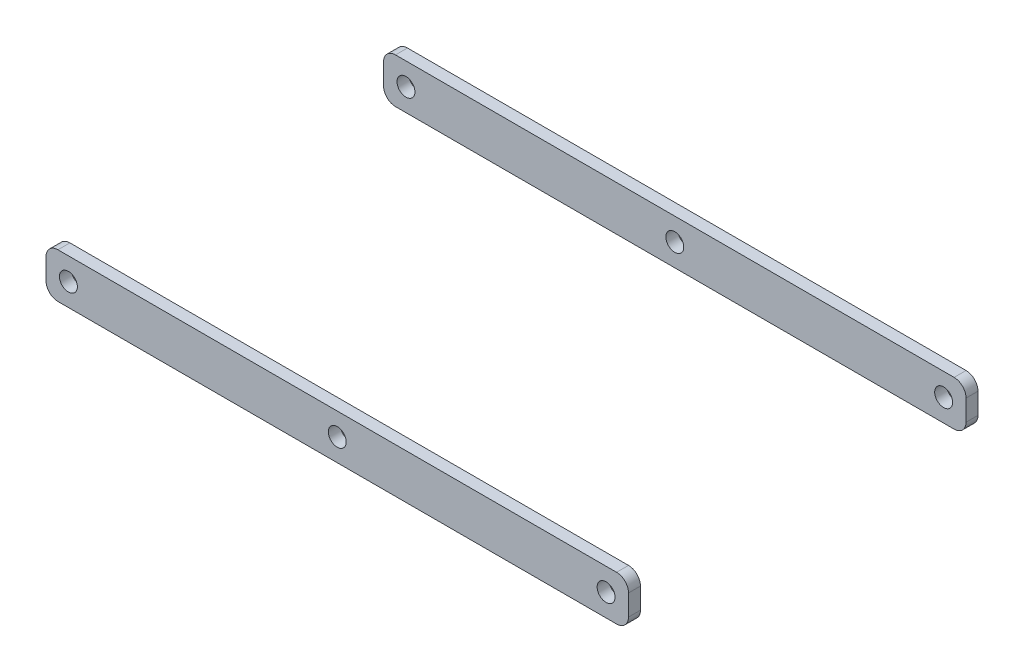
ISO-10303-21;
HEADER;
FILE_DESCRIPTION(('STEP AP214'),'2;1');
FILE_NAME('part.step','',(''),(''),'','','');
FILE_SCHEMA(('AUTOMOTIVE_DESIGN { 1 0 10303 214 1 1 1 1 }'));
ENDSEC;
DATA;
#1=APPLICATION_CONTEXT('core data for automotive mechanical design processes');
#2=APPLICATION_PROTOCOL_DEFINITION('international standard','automotive_design',2000,#1);
#3=PRODUCT_CONTEXT('',#1,'mechanical');
#4=PRODUCT('Part','Part','',(#3));
#5=PRODUCT_RELATED_PRODUCT_CATEGORY('part','',(#4));
#6=PRODUCT_DEFINITION_FORMATION('','',#4);
#7=PRODUCT_DEFINITION_CONTEXT('part definition',#1,'design');
#8=PRODUCT_DEFINITION('design','',#6,#7);
#9=PRODUCT_DEFINITION_SHAPE('','',#8);
#10=(LENGTH_UNIT() NAMED_UNIT(*) SI_UNIT(.MILLI.,.METRE.));
#11=(NAMED_UNIT(*) PLANE_ANGLE_UNIT() SI_UNIT($,.RADIAN.));
#12=(NAMED_UNIT(*) SI_UNIT($,.STERADIAN.) SOLID_ANGLE_UNIT());
#13=UNCERTAINTY_MEASURE_WITH_UNIT(LENGTH_MEASURE(1.E-05),#10,'distance_accuracy_value','');
#14=(GEOMETRIC_REPRESENTATION_CONTEXT(3) GLOBAL_UNCERTAINTY_ASSIGNED_CONTEXT((#13)) GLOBAL_UNIT_ASSIGNED_CONTEXT((#10,
#11,#12)) REPRESENTATION_CONTEXT('',''));
#15=CARTESIAN_POINT('',(0.,0.,0.));
#16=DIRECTION('',(0.,0.,1.));
#17=DIRECTION('',(1.,0.,0.));
#18=AXIS2_PLACEMENT_3D('',#15,#16,#17);
#19=CARTESIAN_POINT('',(195.,-15.,-117.));
#20=DIRECTION('',(1.,0.,0.));
#21=DIRECTION('',(0.,0.,-1.));
#22=AXIS2_PLACEMENT_3D('',#19,#20,#21);
#23=PLANE('',#22);
#24=DIRECTION('',(0.,1.,0.));
#25=VECTOR('',#24,1.);
#26=CARTESIAN_POINT('',(195.,-15.,-117.));
#27=LINE('',#26,#25);
#28=CARTESIAN_POINT('',(195.,-7.,-117.));
#29=VERTEX_POINT('',#28);
#30=CARTESIAN_POINT('',(195.,7.,-117.));
#31=VERTEX_POINT('',#30);
#32=EDGE_CURVE('E175',#29,#31,#27,.T.);
#33=ORIENTED_EDGE('',*,*,#32,.T.);
#34=DIRECTION('',(0.,0.,1.));
#35=VECTOR('',#34,1.);
#36=CARTESIAN_POINT('',(195.,7.,-117.));
#37=LINE('',#36,#35);
#38=CARTESIAN_POINT('',(195.,7.,-109.));
#39=VERTEX_POINT('',#38);
#40=EDGE_CURVE('E136',#31,#39,#37,.T.);
#41=ORIENTED_EDGE('',*,*,#40,.T.);
#42=DIRECTION('',(0.,1.,0.));
#43=VECTOR('',#42,1.);
#44=CARTESIAN_POINT('',(195.,-15.,-109.));
#45=LINE('',#44,#43);
#46=CARTESIAN_POINT('',(195.,-7.,-109.));
#47=VERTEX_POINT('',#46);
#48=EDGE_CURVE('E120',#47,#39,#45,.T.);
#49=ORIENTED_EDGE('',*,*,#48,.F.);
#50=DIRECTION('',(0.,0.,1.));
#51=VECTOR('',#50,1.);
#52=CARTESIAN_POINT('',(195.,-7.,-117.));
#53=LINE('',#52,#51);
#54=EDGE_CURVE('E133',#47,#29,#53,.F.);
#55=ORIENTED_EDGE('',*,*,#54,.T.);
#56=EDGE_LOOP('',(#33,#41,#49,#55));
#57=FACE_BOUND('',#56,.T.);
#58=ADVANCED_FACE('F51',(#57),#23,.T.);
#59=CARTESIAN_POINT('',(-195.,-15.,-117.));
#60=DIRECTION('',(0.,-1.,0.));
#61=DIRECTION('',(0.,0.,-1.));
#62=AXIS2_PLACEMENT_3D('',#59,#60,#61);
#63=PLANE('',#62);
#64=DIRECTION('',(1.,0.,0.));
#65=VECTOR('',#64,1.);
#66=CARTESIAN_POINT('',(-195.,-15.,-117.));
#67=LINE('',#66,#65);
#68=CARTESIAN_POINT('',(-187.,-15.,-117.));
#69=VERTEX_POINT('',#68);
#70=CARTESIAN_POINT('',(187.,-15.,-117.));
#71=VERTEX_POINT('',#70);
#72=EDGE_CURVE('E173',#69,#71,#67,.T.);
#73=ORIENTED_EDGE('',*,*,#72,.T.);
#74=DIRECTION('',(0.,0.,1.));
#75=VECTOR('',#74,1.);
#76=CARTESIAN_POINT('',(187.,-15.,-117.));
#77=LINE('',#76,#75);
#78=CARTESIAN_POINT('',(187.,-15.,-109.));
#79=VERTEX_POINT('',#78);
#80=EDGE_CURVE('E168',#71,#79,#77,.T.);
#81=ORIENTED_EDGE('',*,*,#80,.T.);
#82=DIRECTION('',(1.,0.,0.));
#83=VECTOR('',#82,1.);
#84=CARTESIAN_POINT('',(-195.,-15.,-109.));
#85=LINE('',#84,#83);
#86=CARTESIAN_POINT('',(-187.,-15.,-109.));
#87=VERTEX_POINT('',#86);
#88=EDGE_CURVE('E122',#87,#79,#85,.T.);
#89=ORIENTED_EDGE('',*,*,#88,.F.);
#90=DIRECTION('',(0.,0.,1.));
#91=VECTOR('',#90,1.);
#92=CARTESIAN_POINT('',(-187.,-15.,-117.));
#93=LINE('',#92,#91);
#94=EDGE_CURVE('E166',#87,#69,#93,.F.);
#95=ORIENTED_EDGE('',*,*,#94,.T.);
#96=EDGE_LOOP('',(#73,#81,#89,#95));
#97=FACE_BOUND('',#96,.T.);
#98=ADVANCED_FACE('F171',(#97),#63,.T.);
#99=CARTESIAN_POINT('',(-195.,-15.,-117.));
#100=DIRECTION('',(-1.,0.,0.));
#101=DIRECTION('',(0.,0.,1.));
#102=AXIS2_PLACEMENT_3D('',#99,#100,#101);
#103=PLANE('',#102);
#104=DIRECTION('',(0.,-1.,0.));
#105=VECTOR('',#104,1.);
#106=CARTESIAN_POINT('',(-195.,-15.,-117.));
#107=LINE('',#106,#105);
#108=CARTESIAN_POINT('',(-195.,7.,-117.));
#109=VERTEX_POINT('',#108);
#110=CARTESIAN_POINT('',(-195.,-7.,-117.));
#111=VERTEX_POINT('',#110);
#112=EDGE_CURVE('E174',#109,#111,#107,.T.);
#113=ORIENTED_EDGE('',*,*,#112,.T.);
#114=DIRECTION('',(0.,0.,1.));
#115=VECTOR('',#114,1.);
#116=CARTESIAN_POINT('',(-195.,-7.,-117.));
#117=LINE('',#116,#115);
#118=CARTESIAN_POINT('',(-195.,-7.,-109.));
#119=VERTEX_POINT('',#118);
#120=EDGE_CURVE('E12',#111,#119,#117,.T.);
#121=ORIENTED_EDGE('',*,*,#120,.T.);
#122=DIRECTION('',(0.,-1.,0.));
#123=VECTOR('',#122,1.);
#124=CARTESIAN_POINT('',(-195.,-15.,-109.));
#125=LINE('',#124,#123);
#126=CARTESIAN_POINT('',(-195.,7.,-109.));
#127=VERTEX_POINT('',#126);
#128=EDGE_CURVE('E146',#127,#119,#125,.T.);
#129=ORIENTED_EDGE('',*,*,#128,.F.);
#130=DIRECTION('',(0.,0.,1.));
#131=VECTOR('',#130,1.);
#132=CARTESIAN_POINT('',(-195.,7.,-117.));
#133=LINE('',#132,#131);
#134=EDGE_CURVE('E59',#127,#109,#133,.F.);
#135=ORIENTED_EDGE('',*,*,#134,.T.);
#136=EDGE_LOOP('',(#113,#121,#129,#135));
#137=FACE_BOUND('',#136,.T.);
#138=ADVANCED_FACE('F227',(#137),#103,.T.);
#139=CARTESIAN_POINT('',(-195.,15.,-117.));
#140=DIRECTION('',(0.,1.,0.));
#141=DIRECTION('',(0.,0.,1.));
#142=AXIS2_PLACEMENT_3D('',#139,#140,#141);
#143=PLANE('',#142);
#144=DIRECTION('',(-1.,0.,0.));
#145=VECTOR('',#144,1.);
#146=CARTESIAN_POINT('',(-195.,15.,-109.));
#147=LINE('',#146,#145);
#148=CARTESIAN_POINT('',(187.,15.,-109.));
#149=VERTEX_POINT('',#148);
#150=CARTESIAN_POINT('',(-187.,15.,-109.));
#151=VERTEX_POINT('',#150);
#152=EDGE_CURVE('E137',#149,#151,#147,.T.);
#153=ORIENTED_EDGE('',*,*,#152,.F.);
#154=DIRECTION('',(0.,0.,1.));
#155=VECTOR('',#154,1.);
#156=CARTESIAN_POINT('',(187.,15.,-117.));
#157=LINE('',#156,#155);
#158=CARTESIAN_POINT('',(187.,15.,-117.));
#159=VERTEX_POINT('',#158);
#160=EDGE_CURVE('E158',#149,#159,#157,.F.);
#161=ORIENTED_EDGE('',*,*,#160,.T.);
#162=DIRECTION('',(-1.,0.,0.));
#163=VECTOR('',#162,1.);
#164=CARTESIAN_POINT('',(-195.,15.,-117.));
#165=LINE('',#164,#163);
#166=CARTESIAN_POINT('',(-187.,15.,-117.));
#167=VERTEX_POINT('',#166);
#168=EDGE_CURVE('E138',#159,#167,#165,.T.);
#169=ORIENTED_EDGE('',*,*,#168,.T.);
#170=DIRECTION('',(0.,0.,1.));
#171=VECTOR('',#170,1.);
#172=CARTESIAN_POINT('',(-187.,15.,-117.));
#173=LINE('',#172,#171);
#174=EDGE_CURVE('E155',#167,#151,#173,.T.);
#175=ORIENTED_EDGE('',*,*,#174,.T.);
#176=EDGE_LOOP('',(#153,#161,#169,#175));
#177=FACE_BOUND('',#176,.T.);
#178=ADVANCED_FACE('F245',(#177),#143,.T.);
#179=CARTESIAN_POINT('',(0.,0.,-117.));
#180=DIRECTION('',(0.,0.,-1.));
#181=DIRECTION('',(-1.,0.,0.));
#182=AXIS2_PLACEMENT_3D('',#179,#180,#181);
#183=PLANE('',#182);
#184=CARTESIAN_POINT('',(-180.,0.,-117.));
#185=DIRECTION('',(0.,0.,-1.));
#186=DIRECTION('',(-1.,0.,0.));
#187=AXIS2_PLACEMENT_3D('',#184,#185,#186);
#188=CIRCLE('',#187,6.00000000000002);
#189=CARTESIAN_POINT('',(-186.,0.,-117.));
#190=VERTEX_POINT('',#189);
#191=EDGE_CURVE('E178',#190,#190,#188,.T.);
#192=ORIENTED_EDGE('',*,*,#191,.F.);
#193=EDGE_LOOP('',(#192));
#194=FACE_BOUND('',#193,.T.);
#195=CARTESIAN_POINT('',(0.,0.,-117.));
#196=DIRECTION('',(0.,0.,-1.));
#197=DIRECTION('',(-1.,0.,0.));
#198=AXIS2_PLACEMENT_3D('',#195,#196,#197);
#199=CIRCLE('',#198,6.);
#200=CARTESIAN_POINT('',(-6.,0.,-117.));
#201=VERTEX_POINT('',#200);
#202=EDGE_CURVE('E192',#201,#201,#199,.T.);
#203=ORIENTED_EDGE('',*,*,#202,.F.);
#204=EDGE_LOOP('',(#203));
#205=FACE_BOUND('',#204,.T.);
#206=CARTESIAN_POINT('',(180.,0.,-117.));
#207=DIRECTION('',(0.,0.,-1.));
#208=DIRECTION('',(-1.,0.,0.));
#209=AXIS2_PLACEMENT_3D('',#206,#207,#208);
#210=CIRCLE('',#209,6.00000000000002);
#211=CARTESIAN_POINT('',(174.,0.,-117.));
#212=VERTEX_POINT('',#211);
#213=EDGE_CURVE('E189',#212,#212,#210,.T.);
#214=ORIENTED_EDGE('',*,*,#213,.F.);
#215=EDGE_LOOP('',(#214));
#216=FACE_BOUND('',#215,.T.);
#217=ORIENTED_EDGE('',*,*,#168,.F.);
#218=CARTESIAN_POINT('',(187.,7.,-117.));
#219=DIRECTION('',(0.,0.,-1.));
#220=DIRECTION('',(-1.,0.,0.));
#221=AXIS2_PLACEMENT_3D('',#218,#219,#220);
#222=CIRCLE('',#221,8.);
#223=EDGE_CURVE('E164',#159,#31,#222,.T.);
#224=ORIENTED_EDGE('',*,*,#223,.T.);
#225=ORIENTED_EDGE('',*,*,#32,.F.);
#226=CARTESIAN_POINT('',(187.,-7.,-117.));
#227=DIRECTION('',(0.,0.,-1.));
#228=DIRECTION('',(-1.,0.,0.));
#229=AXIS2_PLACEMENT_3D('',#226,#227,#228);
#230=CIRCLE('',#229,8.);
#231=EDGE_CURVE('E142',#29,#71,#230,.T.);
#232=ORIENTED_EDGE('',*,*,#231,.T.);
#233=ORIENTED_EDGE('',*,*,#72,.F.);
#234=CARTESIAN_POINT('',(-187.,-7.,-117.));
#235=DIRECTION('',(0.,0.,-1.));
#236=DIRECTION('',(-1.,0.,0.));
#237=AXIS2_PLACEMENT_3D('',#234,#235,#236);
#238=CIRCLE('',#237,8.);
#239=EDGE_CURVE('E66',#69,#111,#238,.T.);
#240=ORIENTED_EDGE('',*,*,#239,.T.);
#241=ORIENTED_EDGE('',*,*,#112,.F.);
#242=CARTESIAN_POINT('',(-187.,7.,-117.));
#243=DIRECTION('',(0.,0.,-1.));
#244=DIRECTION('',(-1.,0.,0.));
#245=AXIS2_PLACEMENT_3D('',#242,#243,#244);
#246=CIRCLE('',#245,8.);
#247=EDGE_CURVE('E160',#109,#167,#246,.T.);
#248=ORIENTED_EDGE('',*,*,#247,.T.);
#249=EDGE_LOOP('',(#217,#224,#225,#232,#233,#240,#241,#248));
#250=FACE_BOUND('',#249,.T.);
#251=ADVANCED_FACE('F249',(#194,#205,#216,#250),#183,.T.);
#252=CARTESIAN_POINT('',(0.,0.,-109.));
#253=DIRECTION('',(0.,0.,-1.));
#254=DIRECTION('',(-1.,0.,0.));
#255=AXIS2_PLACEMENT_3D('',#252,#253,#254);
#256=PLANE('',#255);
#257=CARTESIAN_POINT('',(-180.,0.,-109.));
#258=DIRECTION('',(0.,0.,-1.));
#259=DIRECTION('',(-1.,0.,0.));
#260=AXIS2_PLACEMENT_3D('',#257,#258,#259);
#261=CIRCLE('',#260,6.00000000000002);
#262=CARTESIAN_POINT('',(-186.,0.,-109.));
#263=VERTEX_POINT('',#262);
#264=EDGE_CURVE('E149',#263,#263,#261,.T.);
#265=ORIENTED_EDGE('',*,*,#264,.T.);
#266=EDGE_LOOP('',(#265));
#267=FACE_BOUND('',#266,.T.);
#268=CARTESIAN_POINT('',(0.,0.,-109.));
#269=DIRECTION('',(0.,0.,-1.));
#270=DIRECTION('',(-1.,0.,0.));
#271=AXIS2_PLACEMENT_3D('',#268,#269,#270);
#272=CIRCLE('',#271,6.);
#273=CARTESIAN_POINT('',(-6.,0.,-109.));
#274=VERTEX_POINT('',#273);
#275=EDGE_CURVE('E190',#274,#274,#272,.T.);
#276=ORIENTED_EDGE('',*,*,#275,.T.);
#277=EDGE_LOOP('',(#276));
#278=FACE_BOUND('',#277,.T.);
#279=CARTESIAN_POINT('',(180.,0.,-109.));
#280=DIRECTION('',(0.,0.,-1.));
#281=DIRECTION('',(-1.,0.,0.));
#282=AXIS2_PLACEMENT_3D('',#279,#280,#281);
#283=CIRCLE('',#282,6.00000000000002);
#284=CARTESIAN_POINT('',(174.,0.,-109.));
#285=VERTEX_POINT('',#284);
#286=EDGE_CURVE('E187',#285,#285,#283,.T.);
#287=ORIENTED_EDGE('',*,*,#286,.T.);
#288=EDGE_LOOP('',(#287));
#289=FACE_BOUND('',#288,.T.);
#290=ORIENTED_EDGE('',*,*,#48,.T.);
#291=CARTESIAN_POINT('',(187.,7.,-109.));
#292=DIRECTION('',(0.,0.,-1.));
#293=DIRECTION('',(-1.,0.,0.));
#294=AXIS2_PLACEMENT_3D('',#291,#292,#293);
#295=CIRCLE('',#294,8.);
#296=EDGE_CURVE('E127',#39,#149,#295,.F.);
#297=ORIENTED_EDGE('',*,*,#296,.T.);
#298=ORIENTED_EDGE('',*,*,#152,.T.);
#299=CARTESIAN_POINT('',(-187.,7.,-109.));
#300=DIRECTION('',(0.,0.,-1.));
#301=DIRECTION('',(-1.,0.,0.));
#302=AXIS2_PLACEMENT_3D('',#299,#300,#301);
#303=CIRCLE('',#302,8.);
#304=EDGE_CURVE('E144',#151,#127,#303,.F.);
#305=ORIENTED_EDGE('',*,*,#304,.T.);
#306=ORIENTED_EDGE('',*,*,#128,.T.);
#307=CARTESIAN_POINT('',(-187.,-7.,-109.));
#308=DIRECTION('',(0.,0.,-1.));
#309=DIRECTION('',(-1.,0.,0.));
#310=AXIS2_PLACEMENT_3D('',#307,#308,#309);
#311=CIRCLE('',#310,8.);
#312=EDGE_CURVE('E128',#119,#87,#311,.F.);
#313=ORIENTED_EDGE('',*,*,#312,.T.);
#314=ORIENTED_EDGE('',*,*,#88,.T.);
#315=CARTESIAN_POINT('',(187.,-7.,-109.));
#316=DIRECTION('',(0.,0.,-1.));
#317=DIRECTION('',(-1.,0.,0.));
#318=AXIS2_PLACEMENT_3D('',#315,#316,#317);
#319=CIRCLE('',#318,8.);
#320=EDGE_CURVE('E117',#79,#47,#319,.F.);
#321=ORIENTED_EDGE('',*,*,#320,.T.);
#322=EDGE_LOOP('',(#290,#297,#298,#305,#306,#313,#314,#321));
#323=FACE_BOUND('',#322,.T.);
#324=ADVANCED_FACE('F119',(#267,#278,#289,#323),#256,.F.);
#325=CARTESIAN_POINT('',(180.,0.,-500.));
#326=DIRECTION('',(0.,0.,1.));
#327=DIRECTION('',(1.,0.,0.));
#328=AXIS2_PLACEMENT_3D('',#325,#326,#327);
#329=CYLINDRICAL_SURFACE('',#328,6.00000000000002);
#330=ORIENTED_EDGE('',*,*,#213,.T.);
#331=EDGE_LOOP('',(#330));
#332=FACE_BOUND('',#331,.T.);
#333=ORIENTED_EDGE('',*,*,#286,.F.);
#334=EDGE_LOOP('',(#333));
#335=FACE_BOUND('',#334,.T.);
#336=ADVANCED_FACE('F220',(#332,#335),#329,.F.);
#337=CARTESIAN_POINT('',(0.,0.,-500.));
#338=DIRECTION('',(0.,0.,1.));
#339=DIRECTION('',(1.,0.,0.));
#340=AXIS2_PLACEMENT_3D('',#337,#338,#339);
#341=CYLINDRICAL_SURFACE('',#340,6.);
#342=ORIENTED_EDGE('',*,*,#202,.T.);
#343=EDGE_LOOP('',(#342));
#344=FACE_BOUND('',#343,.T.);
#345=ORIENTED_EDGE('',*,*,#275,.F.);
#346=EDGE_LOOP('',(#345));
#347=FACE_BOUND('',#346,.T.);
#348=ADVANCED_FACE('F211',(#344,#347),#341,.F.);
#349=CARTESIAN_POINT('',(-180.,0.,-500.));
#350=DIRECTION('',(0.,0.,1.));
#351=DIRECTION('',(1.,0.,0.));
#352=AXIS2_PLACEMENT_3D('',#349,#350,#351);
#353=CYLINDRICAL_SURFACE('',#352,6.00000000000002);
#354=ORIENTED_EDGE('',*,*,#191,.T.);
#355=EDGE_LOOP('',(#354));
#356=FACE_BOUND('',#355,.T.);
#357=ORIENTED_EDGE('',*,*,#264,.F.);
#358=EDGE_LOOP('',(#357));
#359=FACE_BOUND('',#358,.T.);
#360=ADVANCED_FACE('F208',(#356,#359),#353,.F.);
#361=CARTESIAN_POINT('',(187.,7.,-117.));
#362=DIRECTION('',(0.,0.,1.));
#363=DIRECTION('',(1.,0.,0.));
#364=AXIS2_PLACEMENT_3D('',#361,#362,#363);
#365=CYLINDRICAL_SURFACE('',#364,8.);
#366=ORIENTED_EDGE('',*,*,#223,.F.);
#367=ORIENTED_EDGE('',*,*,#160,.F.);
#368=ORIENTED_EDGE('',*,*,#296,.F.);
#369=ORIENTED_EDGE('',*,*,#40,.F.);
#370=EDGE_LOOP('',(#366,#367,#368,#369));
#371=FACE_BOUND('',#370,.T.);
#372=ADVANCED_FACE('F210',(#371),#365,.T.);
#373=CARTESIAN_POINT('',(187.,-7.,-117.));
#374=DIRECTION('',(0.,0.,1.));
#375=DIRECTION('',(1.,0.,0.));
#376=AXIS2_PLACEMENT_3D('',#373,#374,#375);
#377=CYLINDRICAL_SURFACE('',#376,8.);
#378=ORIENTED_EDGE('',*,*,#231,.F.);
#379=ORIENTED_EDGE('',*,*,#54,.F.);
#380=ORIENTED_EDGE('',*,*,#320,.F.);
#381=ORIENTED_EDGE('',*,*,#80,.F.);
#382=EDGE_LOOP('',(#378,#379,#380,#381));
#383=FACE_BOUND('',#382,.T.);
#384=ADVANCED_FACE('F141',(#383),#377,.T.);
#385=CARTESIAN_POINT('',(-187.,-7.,-117.));
#386=DIRECTION('',(0.,0.,1.));
#387=DIRECTION('',(1.,0.,0.));
#388=AXIS2_PLACEMENT_3D('',#385,#386,#387);
#389=CYLINDRICAL_SURFACE('',#388,8.);
#390=ORIENTED_EDGE('',*,*,#239,.F.);
#391=ORIENTED_EDGE('',*,*,#94,.F.);
#392=ORIENTED_EDGE('',*,*,#312,.F.);
#393=ORIENTED_EDGE('',*,*,#120,.F.);
#394=EDGE_LOOP('',(#390,#391,#392,#393));
#395=FACE_BOUND('',#394,.T.);
#396=ADVANCED_FACE('F232',(#395),#389,.T.);
#397=CARTESIAN_POINT('',(-187.,7.,-117.));
#398=DIRECTION('',(0.,0.,1.));
#399=DIRECTION('',(1.,0.,0.));
#400=AXIS2_PLACEMENT_3D('',#397,#398,#399);
#401=CYLINDRICAL_SURFACE('',#400,8.);
#402=ORIENTED_EDGE('',*,*,#247,.F.);
#403=ORIENTED_EDGE('',*,*,#134,.F.);
#404=ORIENTED_EDGE('',*,*,#304,.F.);
#405=ORIENTED_EDGE('',*,*,#174,.F.);
#406=EDGE_LOOP('',(#402,#403,#404,#405));
#407=FACE_BOUND('',#406,.T.);
#408=ADVANCED_FACE('F53',(#407),#401,.T.);
#409=CLOSED_SHELL('',(#58,#98,#138,#178,#251,#324,#336,#348,#360,#372,#384,#396,#408));
#410=MANIFOLD_SOLID_BREP('B2',#409);
#411=CARTESIAN_POINT('',(0.,0.,117.));
#412=DIRECTION('',(0.,0.,-1.));
#413=DIRECTION('',(-1.,0.,0.));
#414=AXIS2_PLACEMENT_3D('',#411,#412,#413);
#415=PLANE('',#414);
#416=CARTESIAN_POINT('',(-180.,0.,117.));
#417=DIRECTION('',(0.,0.,-1.));
#418=DIRECTION('',(-1.,0.,0.));
#419=AXIS2_PLACEMENT_3D('',#416,#417,#418);
#420=CIRCLE('',#419,6.00000000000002);
#421=CARTESIAN_POINT('',(-186.,0.,117.));
#422=VERTEX_POINT('',#421);
#423=EDGE_CURVE('E473',#422,#422,#420,.T.);
#424=ORIENTED_EDGE('',*,*,#423,.T.);
#425=EDGE_LOOP('',(#424));
#426=FACE_BOUND('',#425,.T.);
#427=CARTESIAN_POINT('',(0.,0.,117.));
#428=DIRECTION('',(0.,0.,-1.));
#429=DIRECTION('',(-1.,0.,0.));
#430=AXIS2_PLACEMENT_3D('',#427,#428,#429);
#431=CIRCLE('',#430,6.);
#432=CARTESIAN_POINT('',(-6.,0.,117.));
#433=VERTEX_POINT('',#432);
#434=EDGE_CURVE('E470',#433,#433,#431,.T.);
#435=ORIENTED_EDGE('',*,*,#434,.T.);
#436=EDGE_LOOP('',(#435));
#437=FACE_BOUND('',#436,.T.);
#438=CARTESIAN_POINT('',(180.,0.,117.));
#439=DIRECTION('',(0.,0.,-1.));
#440=DIRECTION('',(-1.,0.,0.));
#441=AXIS2_PLACEMENT_3D('',#438,#439,#440);
#442=CIRCLE('',#441,6.00000000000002);
#443=CARTESIAN_POINT('',(174.,0.,117.));
#444=VERTEX_POINT('',#443);
#445=EDGE_CURVE('E466',#444,#444,#442,.T.);
#446=ORIENTED_EDGE('',*,*,#445,.T.);
#447=EDGE_LOOP('',(#446));
#448=FACE_BOUND('',#447,.T.);
#449=DIRECTION('',(0.,1.,0.));
#450=VECTOR('',#449,1.);
#451=CARTESIAN_POINT('',(195.,-15.,117.));
#452=LINE('',#451,#450);
#453=CARTESIAN_POINT('',(195.,-7.,117.));
#454=VERTEX_POINT('',#453);
#455=CARTESIAN_POINT('',(195.,7.,117.));
#456=VERTEX_POINT('',#455);
#457=EDGE_CURVE('E416',#454,#456,#452,.T.);
#458=ORIENTED_EDGE('',*,*,#457,.T.);
#459=CARTESIAN_POINT('',(187.,7.,117.));
#460=DIRECTION('',(0.,0.,-1.));
#461=DIRECTION('',(-1.,0.,0.));
#462=AXIS2_PLACEMENT_3D('',#459,#460,#461);
#463=CIRCLE('',#462,8.);
#464=CARTESIAN_POINT('',(187.,15.,117.));
#465=VERTEX_POINT('',#464);
#466=EDGE_CURVE('E480',#456,#465,#463,.F.);
#467=ORIENTED_EDGE('',*,*,#466,.T.);
#468=DIRECTION('',(-1.,0.,0.));
#469=VECTOR('',#468,1.);
#470=CARTESIAN_POINT('',(-195.,15.,117.));
#471=LINE('',#470,#469);
#472=CARTESIAN_POINT('',(-187.,15.,117.));
#473=VERTEX_POINT('',#472);
#474=EDGE_CURVE('E459',#465,#473,#471,.T.);
#475=ORIENTED_EDGE('',*,*,#474,.T.);
#476=CARTESIAN_POINT('',(-187.,7.,117.));
#477=DIRECTION('',(0.,0.,-1.));
#478=DIRECTION('',(-1.,0.,0.));
#479=AXIS2_PLACEMENT_3D('',#476,#477,#478);
#480=CIRCLE('',#479,8.);
#481=CARTESIAN_POINT('',(-195.,7.,117.));
#482=VERTEX_POINT('',#481);
#483=EDGE_CURVE('E478',#473,#482,#480,.F.);
#484=ORIENTED_EDGE('',*,*,#483,.T.);
#485=DIRECTION('',(0.,-1.,0.));
#486=VECTOR('',#485,1.);
#487=CARTESIAN_POINT('',(-195.,-15.,117.));
#488=LINE('',#487,#486);
#489=CARTESIAN_POINT('',(-195.,-7.,117.));
#490=VERTEX_POINT('',#489);
#491=EDGE_CURVE('E455',#482,#490,#488,.T.);
#492=ORIENTED_EDGE('',*,*,#491,.T.);
#493=CARTESIAN_POINT('',(-187.,-7.,117.));
#494=DIRECTION('',(0.,0.,-1.));
#495=DIRECTION('',(-1.,0.,0.));
#496=AXIS2_PLACEMENT_3D('',#493,#494,#495);
#497=CIRCLE('',#496,8.);
#498=CARTESIAN_POINT('',(-187.,-15.,117.));
#499=VERTEX_POINT('',#498);
#500=EDGE_CURVE('E454',#490,#499,#497,.F.);
#501=ORIENTED_EDGE('',*,*,#500,.T.);
#502=DIRECTION('',(1.,0.,0.));
#503=VECTOR('',#502,1.);
#504=CARTESIAN_POINT('',(-195.,-15.,117.));
#505=LINE('',#504,#503);
#506=CARTESIAN_POINT('',(187.,-15.,117.));
#507=VERTEX_POINT('',#506);
#508=EDGE_CURVE('E449',#499,#507,#505,.T.);
#509=ORIENTED_EDGE('',*,*,#508,.T.);
#510=CARTESIAN_POINT('',(187.,-7.,117.));
#511=DIRECTION('',(0.,0.,-1.));
#512=DIRECTION('',(-1.,0.,0.));
#513=AXIS2_PLACEMENT_3D('',#510,#511,#512);
#514=CIRCLE('',#513,8.);
#515=EDGE_CURVE('E452',#507,#454,#514,.F.);
#516=ORIENTED_EDGE('',*,*,#515,.T.);
#517=EDGE_LOOP('',(#458,#467,#475,#484,#492,#501,#509,#516));
#518=FACE_BOUND('',#517,.T.);
#519=ADVANCED_FACE('F342',(#426,#437,#448,#518),#415,.F.);
#520=CARTESIAN_POINT('',(-195.,15.,-117.));
#521=DIRECTION('',(0.,1.,0.));
#522=DIRECTION('',(0.,0.,1.));
#523=AXIS2_PLACEMENT_3D('',#520,#521,#522);
#524=PLANE('',#523);
#525=ORIENTED_EDGE('',*,*,#474,.F.);
#526=DIRECTION('',(0.,0.,1.));
#527=VECTOR('',#526,1.);
#528=CARTESIAN_POINT('',(187.,15.,-117.));
#529=LINE('',#528,#527);
#530=CARTESIAN_POINT('',(187.,15.,109.));
#531=VERTEX_POINT('',#530);
#532=EDGE_CURVE('E432',#465,#531,#529,.F.);
#533=ORIENTED_EDGE('',*,*,#532,.T.);
#534=DIRECTION('',(-1.,0.,0.));
#535=VECTOR('',#534,1.);
#536=CARTESIAN_POINT('',(-195.,15.,109.));
#537=LINE('',#536,#535);
#538=CARTESIAN_POINT('',(-187.,15.,109.));
#539=VERTEX_POINT('',#538);
#540=EDGE_CURVE('E420',#531,#539,#537,.T.);
#541=ORIENTED_EDGE('',*,*,#540,.T.);
#542=DIRECTION('',(0.,0.,1.));
#543=VECTOR('',#542,1.);
#544=CARTESIAN_POINT('',(-187.,15.,-117.));
#545=LINE('',#544,#543);
#546=EDGE_CURVE('E436',#539,#473,#545,.T.);
#547=ORIENTED_EDGE('',*,*,#546,.T.);
#548=EDGE_LOOP('',(#525,#533,#541,#547));
#549=FACE_BOUND('',#548,.T.);
#550=ADVANCED_FACE('F486',(#549),#524,.T.);
#551=CARTESIAN_POINT('',(-195.,-15.,-117.));
#552=DIRECTION('',(-1.,0.,0.));
#553=DIRECTION('',(0.,0.,1.));
#554=AXIS2_PLACEMENT_3D('',#551,#552,#553);
#555=PLANE('',#554);
#556=ORIENTED_EDGE('',*,*,#491,.F.);
#557=DIRECTION('',(0.,0.,1.));
#558=VECTOR('',#557,1.);
#559=CARTESIAN_POINT('',(-195.,7.,-117.));
#560=LINE('',#559,#558);
#561=CARTESIAN_POINT('',(-195.,7.,109.));
#562=VERTEX_POINT('',#561);
#563=EDGE_CURVE('E364',#482,#562,#560,.F.);
#564=ORIENTED_EDGE('',*,*,#563,.T.);
#565=DIRECTION('',(0.,-1.,0.));
#566=VECTOR('',#565,1.);
#567=CARTESIAN_POINT('',(-195.,-15.,109.));
#568=LINE('',#567,#566);
#569=CARTESIAN_POINT('',(-195.,-7.,109.));
#570=VERTEX_POINT('',#569);
#571=EDGE_CURVE('E493',#562,#570,#568,.T.);
#572=ORIENTED_EDGE('',*,*,#571,.T.);
#573=DIRECTION('',(0.,0.,1.));
#574=VECTOR('',#573,1.);
#575=CARTESIAN_POINT('',(-195.,-7.,-117.));
#576=LINE('',#575,#574);
#577=EDGE_CURVE('E442',#570,#490,#576,.T.);
#578=ORIENTED_EDGE('',*,*,#577,.T.);
#579=EDGE_LOOP('',(#556,#564,#572,#578));
#580=FACE_BOUND('',#579,.T.);
#581=ADVANCED_FACE('F524',(#580),#555,.T.);
#582=CARTESIAN_POINT('',(-195.,-15.,-117.));
#583=DIRECTION('',(0.,-1.,0.));
#584=DIRECTION('',(0.,0.,-1.));
#585=AXIS2_PLACEMENT_3D('',#582,#583,#584);
#586=PLANE('',#585);
#587=ORIENTED_EDGE('',*,*,#508,.F.);
#588=DIRECTION('',(0.,0.,1.));
#589=VECTOR('',#588,1.);
#590=CARTESIAN_POINT('',(-187.,-15.,-117.));
#591=LINE('',#590,#589);
#592=CARTESIAN_POINT('',(-187.,-15.,109.));
#593=VERTEX_POINT('',#592);
#594=EDGE_CURVE('E49',#499,#593,#591,.F.);
#595=ORIENTED_EDGE('',*,*,#594,.T.);
#596=DIRECTION('',(1.,0.,0.));
#597=VECTOR('',#596,1.);
#598=CARTESIAN_POINT('',(-195.,-15.,109.));
#599=LINE('',#598,#597);
#600=CARTESIAN_POINT('',(187.,-15.,109.));
#601=VERTEX_POINT('',#600);
#602=EDGE_CURVE('E428',#593,#601,#599,.T.);
#603=ORIENTED_EDGE('',*,*,#602,.T.);
#604=DIRECTION('',(0.,0.,1.));
#605=VECTOR('',#604,1.);
#606=CARTESIAN_POINT('',(187.,-15.,-117.));
#607=LINE('',#606,#605);
#608=EDGE_CURVE('E350',#601,#507,#607,.T.);
#609=ORIENTED_EDGE('',*,*,#608,.T.);
#610=EDGE_LOOP('',(#587,#595,#603,#609));
#611=FACE_BOUND('',#610,.T.);
#612=ADVANCED_FACE('F448',(#611),#586,.T.);
#613=CARTESIAN_POINT('',(195.,-15.,-117.));
#614=DIRECTION('',(1.,0.,0.));
#615=DIRECTION('',(0.,0.,-1.));
#616=AXIS2_PLACEMENT_3D('',#613,#614,#615);
#617=PLANE('',#616);
#618=DIRECTION('',(0.,1.,0.));
#619=VECTOR('',#618,1.);
#620=CARTESIAN_POINT('',(195.,-15.,109.));
#621=LINE('',#620,#619);
#622=CARTESIAN_POINT('',(195.,-7.,109.));
#623=VERTEX_POINT('',#622);
#624=CARTESIAN_POINT('',(195.,7.,109.));
#625=VERTEX_POINT('',#624);
#626=EDGE_CURVE('E413',#623,#625,#621,.T.);
#627=ORIENTED_EDGE('',*,*,#626,.T.);
#628=DIRECTION('',(0.,0.,1.));
#629=VECTOR('',#628,1.);
#630=CARTESIAN_POINT('',(195.,7.,-117.));
#631=LINE('',#630,#629);
#632=EDGE_CURVE('E419',#625,#456,#631,.T.);
#633=ORIENTED_EDGE('',*,*,#632,.T.);
#634=ORIENTED_EDGE('',*,*,#457,.F.);
#635=DIRECTION('',(0.,0.,1.));
#636=VECTOR('',#635,1.);
#637=CARTESIAN_POINT('',(195.,-7.,-117.));
#638=LINE('',#637,#636);
#639=EDGE_CURVE('E409',#454,#623,#638,.F.);
#640=ORIENTED_EDGE('',*,*,#639,.T.);
#641=EDGE_LOOP('',(#627,#633,#634,#640));
#642=FACE_BOUND('',#641,.T.);
#643=ADVANCED_FACE('F411',(#642),#617,.T.);
#644=CARTESIAN_POINT('',(0.,0.,109.));
#645=DIRECTION('',(0.,0.,-1.));
#646=DIRECTION('',(-1.,0.,0.));
#647=AXIS2_PLACEMENT_3D('',#644,#645,#646);
#648=PLANE('',#647);
#649=CARTESIAN_POINT('',(-180.,0.,109.));
#650=DIRECTION('',(0.,0.,-1.));
#651=DIRECTION('',(-1.,0.,0.));
#652=AXIS2_PLACEMENT_3D('',#649,#650,#651);
#653=CIRCLE('',#652,6.00000000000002);
#654=CARTESIAN_POINT('',(-186.,0.,109.));
#655=VERTEX_POINT('',#654);
#656=EDGE_CURVE('E471',#655,#655,#653,.T.);
#657=ORIENTED_EDGE('',*,*,#656,.F.);
#658=EDGE_LOOP('',(#657));
#659=FACE_BOUND('',#658,.T.);
#660=CARTESIAN_POINT('',(0.,0.,109.));
#661=DIRECTION('',(0.,0.,-1.));
#662=DIRECTION('',(-1.,0.,0.));
#663=AXIS2_PLACEMENT_3D('',#660,#661,#662);
#664=CIRCLE('',#663,6.);
#665=CARTESIAN_POINT('',(-6.,0.,109.));
#666=VERTEX_POINT('',#665);
#667=EDGE_CURVE('E467',#666,#666,#664,.T.);
#668=ORIENTED_EDGE('',*,*,#667,.F.);
#669=EDGE_LOOP('',(#668));
#670=FACE_BOUND('',#669,.T.);
#671=CARTESIAN_POINT('',(180.,0.,109.));
#672=DIRECTION('',(0.,0.,-1.));
#673=DIRECTION('',(-1.,0.,0.));
#674=AXIS2_PLACEMENT_3D('',#671,#672,#673);
#675=CIRCLE('',#674,6.00000000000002);
#676=CARTESIAN_POINT('',(174.,0.,109.));
#677=VERTEX_POINT('',#676);
#678=EDGE_CURVE('E463',#677,#677,#675,.T.);
#679=ORIENTED_EDGE('',*,*,#678,.F.);
#680=EDGE_LOOP('',(#679));
#681=FACE_BOUND('',#680,.T.);
#682=ORIENTED_EDGE('',*,*,#540,.F.);
#683=CARTESIAN_POINT('',(187.,7.,109.));
#684=DIRECTION('',(0.,0.,-1.));
#685=DIRECTION('',(-1.,0.,0.));
#686=AXIS2_PLACEMENT_3D('',#683,#684,#685);
#687=CIRCLE('',#686,8.);
#688=EDGE_CURVE('E427',#531,#625,#687,.T.);
#689=ORIENTED_EDGE('',*,*,#688,.T.);
#690=ORIENTED_EDGE('',*,*,#626,.F.);
#691=CARTESIAN_POINT('',(187.,-7.,109.));
#692=DIRECTION('',(0.,0.,-1.));
#693=DIRECTION('',(-1.,0.,0.));
#694=AXIS2_PLACEMENT_3D('',#691,#692,#693);
#695=CIRCLE('',#694,8.);
#696=EDGE_CURVE('E424',#623,#601,#695,.T.);
#697=ORIENTED_EDGE('',*,*,#696,.T.);
#698=ORIENTED_EDGE('',*,*,#602,.F.);
#699=CARTESIAN_POINT('',(-187.,-7.,109.));
#700=DIRECTION('',(0.,0.,-1.));
#701=DIRECTION('',(-1.,0.,0.));
#702=AXIS2_PLACEMENT_3D('',#699,#700,#701);
#703=CIRCLE('',#702,8.);
#704=EDGE_CURVE('E357',#593,#570,#703,.T.);
#705=ORIENTED_EDGE('',*,*,#704,.T.);
#706=ORIENTED_EDGE('',*,*,#571,.F.);
#707=CARTESIAN_POINT('',(-187.,7.,109.));
#708=DIRECTION('',(0.,0.,-1.));
#709=DIRECTION('',(-1.,0.,0.));
#710=AXIS2_PLACEMENT_3D('',#707,#708,#709);
#711=CIRCLE('',#710,8.);
#712=EDGE_CURVE('E434',#562,#539,#711,.T.);
#713=ORIENTED_EDGE('',*,*,#712,.T.);
#714=EDGE_LOOP('',(#682,#689,#690,#697,#698,#705,#706,#713));
#715=FACE_BOUND('',#714,.T.);
#716=ADVANCED_FACE('F423',(#659,#670,#681,#715),#648,.T.);
#717=CARTESIAN_POINT('',(180.,0.,-500.));
#718=DIRECTION('',(0.,0.,1.));
#719=DIRECTION('',(1.,0.,0.));
#720=AXIS2_PLACEMENT_3D('',#717,#718,#719);
#721=CYLINDRICAL_SURFACE('',#720,6.00000000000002);
#722=ORIENTED_EDGE('',*,*,#678,.T.);
#723=EDGE_LOOP('',(#722));
#724=FACE_BOUND('',#723,.T.);
#725=ORIENTED_EDGE('',*,*,#445,.F.);
#726=EDGE_LOOP('',(#725));
#727=FACE_BOUND('',#726,.T.);
#728=ADVANCED_FACE('F503',(#724,#727),#721,.F.);
#729=CARTESIAN_POINT('',(0.,0.,-500.));
#730=DIRECTION('',(0.,0.,1.));
#731=DIRECTION('',(1.,0.,0.));
#732=AXIS2_PLACEMENT_3D('',#729,#730,#731);
#733=CYLINDRICAL_SURFACE('',#732,6.);
#734=ORIENTED_EDGE('',*,*,#667,.T.);
#735=EDGE_LOOP('',(#734));
#736=FACE_BOUND('',#735,.T.);
#737=ORIENTED_EDGE('',*,*,#434,.F.);
#738=EDGE_LOOP('',(#737));
#739=FACE_BOUND('',#738,.T.);
#740=ADVANCED_FACE('F505',(#736,#739),#733,.F.);
#741=CARTESIAN_POINT('',(-180.,0.,-500.));
#742=DIRECTION('',(0.,0.,1.));
#743=DIRECTION('',(1.,0.,0.));
#744=AXIS2_PLACEMENT_3D('',#741,#742,#743);
#745=CYLINDRICAL_SURFACE('',#744,6.00000000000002);
#746=ORIENTED_EDGE('',*,*,#656,.T.);
#747=EDGE_LOOP('',(#746));
#748=FACE_BOUND('',#747,.T.);
#749=ORIENTED_EDGE('',*,*,#423,.F.);
#750=EDGE_LOOP('',(#749));
#751=FACE_BOUND('',#750,.T.);
#752=ADVANCED_FACE('F511',(#748,#751),#745,.F.);
#753=CARTESIAN_POINT('',(187.,7.,-117.));
#754=DIRECTION('',(0.,0.,1.));
#755=DIRECTION('',(1.,0.,0.));
#756=AXIS2_PLACEMENT_3D('',#753,#754,#755);
#757=CYLINDRICAL_SURFACE('',#756,8.);
#758=ORIENTED_EDGE('',*,*,#688,.F.);
#759=ORIENTED_EDGE('',*,*,#532,.F.);
#760=ORIENTED_EDGE('',*,*,#466,.F.);
#761=ORIENTED_EDGE('',*,*,#632,.F.);
#762=EDGE_LOOP('',(#758,#759,#760,#761));
#763=FACE_BOUND('',#762,.T.);
#764=ADVANCED_FACE('F534',(#763),#757,.T.);
#765=CARTESIAN_POINT('',(-187.,7.,-117.));
#766=DIRECTION('',(0.,0.,1.));
#767=DIRECTION('',(1.,0.,0.));
#768=AXIS2_PLACEMENT_3D('',#765,#766,#767);
#769=CYLINDRICAL_SURFACE('',#768,8.);
#770=ORIENTED_EDGE('',*,*,#712,.F.);
#771=ORIENTED_EDGE('',*,*,#563,.F.);
#772=ORIENTED_EDGE('',*,*,#483,.F.);
#773=ORIENTED_EDGE('',*,*,#546,.F.);
#774=EDGE_LOOP('',(#770,#771,#772,#773));
#775=FACE_BOUND('',#774,.T.);
#776=ADVANCED_FACE('F537',(#775),#769,.T.);
#777=CARTESIAN_POINT('',(-187.,-7.,-117.));
#778=DIRECTION('',(0.,0.,1.));
#779=DIRECTION('',(1.,0.,0.));
#780=AXIS2_PLACEMENT_3D('',#777,#778,#779);
#781=CYLINDRICAL_SURFACE('',#780,8.);
#782=ORIENTED_EDGE('',*,*,#704,.F.);
#783=ORIENTED_EDGE('',*,*,#594,.F.);
#784=ORIENTED_EDGE('',*,*,#500,.F.);
#785=ORIENTED_EDGE('',*,*,#577,.F.);
#786=EDGE_LOOP('',(#782,#783,#784,#785));
#787=FACE_BOUND('',#786,.T.);
#788=ADVANCED_FACE('F540',(#787),#781,.T.);
#789=CARTESIAN_POINT('',(187.,-7.,-117.));
#790=DIRECTION('',(0.,0.,1.));
#791=DIRECTION('',(1.,0.,0.));
#792=AXIS2_PLACEMENT_3D('',#789,#790,#791);
#793=CYLINDRICAL_SURFACE('',#792,8.);
#794=ORIENTED_EDGE('',*,*,#696,.F.);
#795=ORIENTED_EDGE('',*,*,#639,.F.);
#796=ORIENTED_EDGE('',*,*,#515,.F.);
#797=ORIENTED_EDGE('',*,*,#608,.F.);
#798=EDGE_LOOP('',(#794,#795,#796,#797));
#799=FACE_BOUND('',#798,.T.);
#800=ADVANCED_FACE('F344',(#799),#793,.T.);
#801=CLOSED_SHELL('',(#519,#550,#581,#612,#643,#716,#728,#740,#752,#764,#776,#788,#800));
#802=MANIFOLD_SOLID_BREP('B6',#801);
#803=ADVANCED_BREP_SHAPE_REPRESENTATION('',(#18,#410,#802),#14);
#804=SHAPE_DEFINITION_REPRESENTATION(#9,#803);
ENDSEC;
END-ISO-10303-21;
